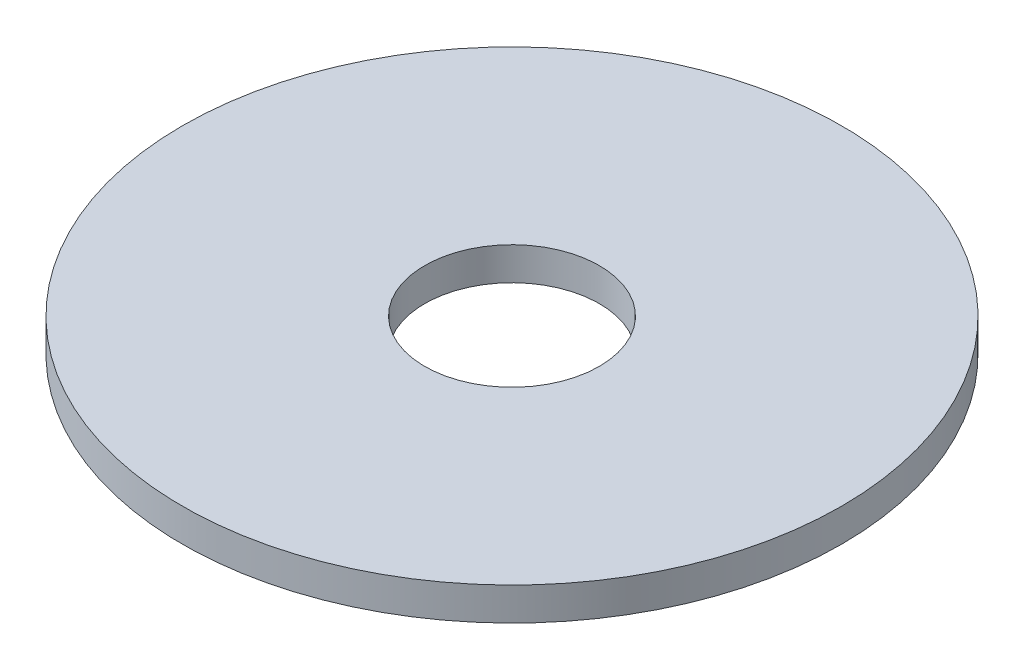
ISO-10303-21;
HEADER;
FILE_DESCRIPTION(('STEP AP214'),'2;1');
FILE_NAME('part.step','',(''),(''),'','','');
FILE_SCHEMA(('AUTOMOTIVE_DESIGN { 1 0 10303 214 1 1 1 1 }'));
ENDSEC;
DATA;
#1=APPLICATION_CONTEXT('core data for automotive mechanical design processes');
#2=APPLICATION_PROTOCOL_DEFINITION('international standard','automotive_design',2000,#1);
#3=PRODUCT_CONTEXT('',#1,'mechanical');
#4=PRODUCT('Part','Part','',(#3));
#5=PRODUCT_RELATED_PRODUCT_CATEGORY('part','',(#4));
#6=PRODUCT_DEFINITION_FORMATION('','',#4);
#7=PRODUCT_DEFINITION_CONTEXT('part definition',#1,'design');
#8=PRODUCT_DEFINITION('design','',#6,#7);
#9=PRODUCT_DEFINITION_SHAPE('','',#8);
#10=(LENGTH_UNIT() NAMED_UNIT(*) SI_UNIT(.MILLI.,.METRE.));
#11=(NAMED_UNIT(*) PLANE_ANGLE_UNIT() SI_UNIT($,.RADIAN.));
#12=(NAMED_UNIT(*) SI_UNIT($,.STERADIAN.) SOLID_ANGLE_UNIT());
#13=UNCERTAINTY_MEASURE_WITH_UNIT(LENGTH_MEASURE(1.E-05),#10,'distance_accuracy_value','');
#14=(GEOMETRIC_REPRESENTATION_CONTEXT(3) GLOBAL_UNCERTAINTY_ASSIGNED_CONTEXT((#13)) GLOBAL_UNIT_ASSIGNED_CONTEXT((#10,
#11,#12)) REPRESENTATION_CONTEXT('',''));
#15=CARTESIAN_POINT('',(0.,0.,0.));
#16=DIRECTION('',(0.,0.,1.));
#17=DIRECTION('',(1.,0.,0.));
#18=AXIS2_PLACEMENT_3D('',#15,#16,#17);
#19=CARTESIAN_POINT('',(-2.64999999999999,1.,0.));
#20=DIRECTION('',(0.,1.,0.));
#21=DIRECTION('',(-1.,0.,0.));
#22=AXIS2_PLACEMENT_3D('',#19,#20,#21);
#23=PLANE('',#22);
#24=CARTESIAN_POINT('',(0.,1.,0.));
#25=DIRECTION('',(0.,-1.,0.));
#26=DIRECTION('',(1.,0.,0.));
#27=AXIS2_PLACEMENT_3D('',#24,#25,#26);
#28=CIRCLE('',#27,9.99999999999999);
#29=CARTESIAN_POINT('',(9.99999999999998,1.,0.));
#30=VERTEX_POINT('',#29);
#31=EDGE_CURVE('E17',#30,#30,#28,.T.);
#32=ORIENTED_EDGE('',*,*,#31,.F.);
#33=EDGE_LOOP('',(#32));
#34=FACE_BOUND('',#33,.T.);
#35=CARTESIAN_POINT('',(0.,1.,0.));
#36=DIRECTION('',(0.,-1.,0.));
#37=DIRECTION('',(1.,0.,0.));
#38=AXIS2_PLACEMENT_3D('',#35,#36,#37);
#39=CIRCLE('',#38,2.64999999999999);
#40=CARTESIAN_POINT('',(2.64999999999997,1.,0.));
#41=VERTEX_POINT('',#40);
#42=EDGE_CURVE('E26',#41,#41,#39,.T.);
#43=ORIENTED_EDGE('',*,*,#42,.T.);
#44=EDGE_LOOP('',(#43));
#45=FACE_BOUND('',#44,.T.);
#46=ADVANCED_FACE('F14',(#34,#45),#23,.T.);
#47=CARTESIAN_POINT('',(0.,-78.74,0.));
#48=DIRECTION('',(0.,-1.,0.));
#49=DIRECTION('',(1.,0.,0.));
#50=AXIS2_PLACEMENT_3D('',#47,#48,#49);
#51=CYLINDRICAL_SURFACE('',#50,9.99999999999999);
#52=ORIENTED_EDGE('',*,*,#31,.T.);
#53=EDGE_LOOP('',(#52));
#54=FACE_BOUND('',#53,.T.);
#55=CARTESIAN_POINT('',(0.,0.,0.));
#56=DIRECTION('',(0.,-1.,0.));
#57=DIRECTION('',(1.,0.,0.));
#58=AXIS2_PLACEMENT_3D('',#55,#56,#57);
#59=CIRCLE('',#58,9.99999999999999);
#60=CARTESIAN_POINT('',(9.99999999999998,0.,0.));
#61=VERTEX_POINT('',#60);
#62=EDGE_CURVE('E21',#61,#61,#59,.T.);
#63=ORIENTED_EDGE('',*,*,#62,.F.);
#64=EDGE_LOOP('',(#63));
#65=FACE_BOUND('',#64,.T.);
#66=ADVANCED_FACE('F34',(#54,#65),#51,.T.);
#67=CARTESIAN_POINT('',(0.,-78.74,0.));
#68=DIRECTION('',(0.,-1.,0.));
#69=DIRECTION('',(1.,0.,0.));
#70=AXIS2_PLACEMENT_3D('',#67,#68,#69);
#71=CYLINDRICAL_SURFACE('',#70,2.64999999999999);
#72=CARTESIAN_POINT('',(0.,0.,0.));
#73=DIRECTION('',(0.,-1.,0.));
#74=DIRECTION('',(1.,0.,0.));
#75=AXIS2_PLACEMENT_3D('',#72,#73,#74);
#76=CIRCLE('',#75,2.64999999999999);
#77=CARTESIAN_POINT('',(2.64999999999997,0.,0.));
#78=VERTEX_POINT('',#77);
#79=EDGE_CURVE('E10',#78,#78,#76,.F.);
#80=ORIENTED_EDGE('',*,*,#79,.F.);
#81=EDGE_LOOP('',(#80));
#82=FACE_BOUND('',#81,.T.);
#83=ORIENTED_EDGE('',*,*,#42,.F.);
#84=EDGE_LOOP('',(#83));
#85=FACE_BOUND('',#84,.T.);
#86=ADVANCED_FACE('F42',(#82,#85),#71,.F.);
#87=CARTESIAN_POINT('',(-10.,0.,0.));
#88=DIRECTION('',(0.,-1.,0.));
#89=DIRECTION('',(1.,0.,0.));
#90=AXIS2_PLACEMENT_3D('',#87,#88,#89);
#91=PLANE('',#90);
#92=ORIENTED_EDGE('',*,*,#79,.T.);
#93=EDGE_LOOP('',(#92));
#94=FACE_BOUND('',#93,.T.);
#95=ORIENTED_EDGE('',*,*,#62,.T.);
#96=EDGE_LOOP('',(#95));
#97=FACE_BOUND('',#96,.T.);
#98=ADVANCED_FACE('F43',(#94,#97),#91,.T.);
#99=CLOSED_SHELL('',(#46,#66,#86,#98));
#100=MANIFOLD_SOLID_BREP('B1',#99);
#101=ADVANCED_BREP_SHAPE_REPRESENTATION('',(#18,#100),#14);
#102=SHAPE_DEFINITION_REPRESENTATION(#9,#101);
ENDSEC;
END-ISO-10303-21;
